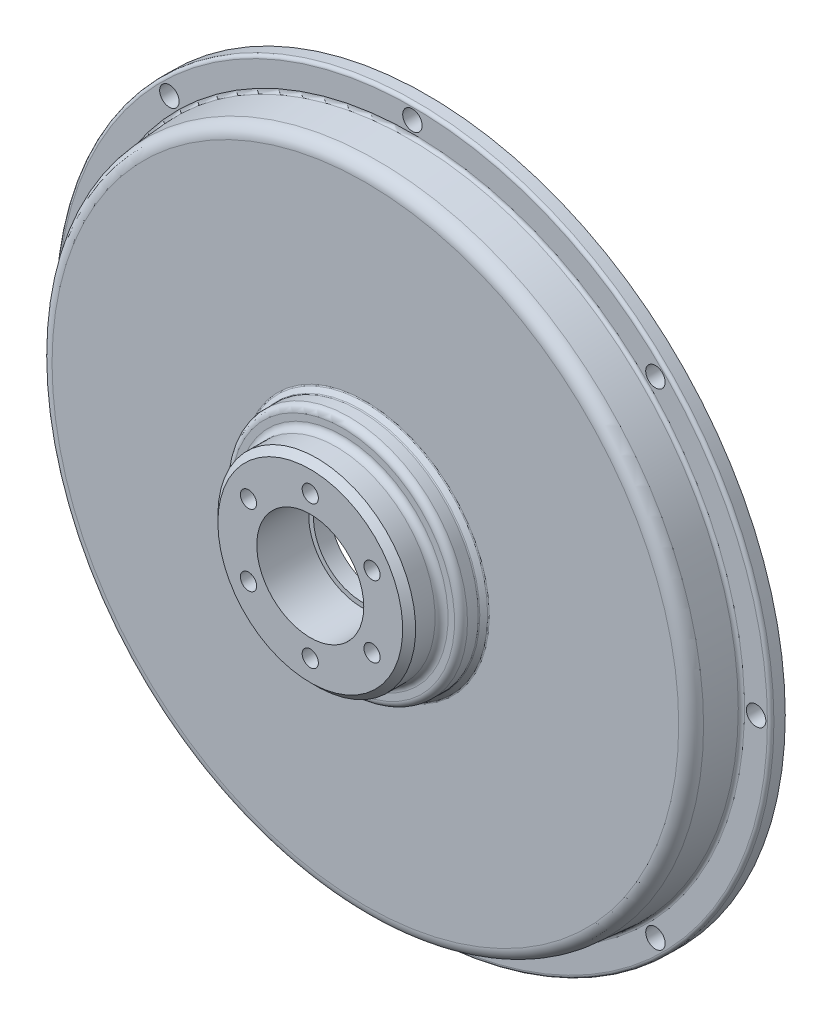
from build123d import *

# Parameters (mm, degrees)
FILLET_1_R          = 0.5
SKETCH_2_R          = 3
CUT_EXTRUDE_1_DEPTH = 10
SKETCH_3_R          = 16.5
CUT_EXTRUDE_2_DEPTH = 16
SKETCH_4_R          = 2.5
CUT_EXTRUDE_3_DEPTH = 15
SKETCH_5_R          = 95
CUT_EXTRUDE_4_DEPTH = 15
SKETCH_6_R          = 15
CUT_EXTRUDE_5_DEPTH = 15


with BuildPart() as part:
    # Sketch 1 → Revolve 1 (revolve)
    with BuildSketch(Plane(origin=(0, 0, 0), x_dir=(1, 0, 0), z_dir=(0, 1, 0))):
        with BuildLine():
            Line((-110.5, 0), (-110.5, -3.5))
            ThreePointArc((-110.5, -3.5), (-110.207106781, -4.207106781), (-109.5, -4.5))
            Line((-109.5, -4.5), (-102.422405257, -4.5))
            ThreePointArc((-102.422405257, -4.5), (-101.744391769, -4.764950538), (-101.425658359, -5.419404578))
            Line((-101.425658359, -5.419404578), (-100.624918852, -15.322381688))
            ThreePointArc((-100.624918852, -15.322381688), (-99.34998521, -17.940197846), (-96.637931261, -19))
            Line((-96.637931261, -19), (-38, -19))
            Line((-38, -19), (-36.5, -20.5))
            Line((-36.5, -20.5), (-36.5, -24))
            ThreePointArc((-36.5, -24), (-35.914213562, -25.414213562), (-34.5, -26))
            Line((-34.5, -26), (-32.5, -26))
            ThreePointArc((-32.5, -26), (-31.085786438, -26.585786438), (-30.5, -28))
            Line((-30.5, -28), (-30.5, -34))
            Line((-30.5, -34), (-28.5, -36))
            Line((-28.5, -36), (0, -36))
            Line((0, -36), (0, 0))
            Line((0, 0), (-110.5, 0))
        make_face()
    revolve(axis=Axis((0, 0, 0), (0, 0, 1)))

    # Fillet 1
    fillet_1_edges = [part.edges().sort_by_distance(p)[0] for p in [
        (38, 0, 19),
        (36.5, 0, 20.5),
    ]]
    fillet(fillet_1_edges, radius=FILLET_1_R)

    # Sketch 2 → Cut-Extrude 1 (cut)
    with BuildSketch(Plane.XY.offset(4.5)):
        with Locations((0, 106)):
            Circle(SKETCH_2_R)
        with Locations((74.953318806, 74.953318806)):
            Circle(SKETCH_2_R)
        with Locations((106, 0)):
            Circle(SKETCH_2_R)
        with Locations((74.953318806, -74.953318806)):
            Circle(SKETCH_2_R)
        with Locations((0, -106)):
            Circle(SKETCH_2_R)
        with Locations((-74.953318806, -74.953318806)):
            Circle(SKETCH_2_R)
        with Locations((-106, 0)):
            Circle(SKETCH_2_R)
        with Locations((-74.953318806, 74.953318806)):
            Circle(SKETCH_2_R)
    extrude(amount=-CUT_EXTRUDE_1_DEPTH, mode=Mode.SUBTRACT)

    # Sketch 3 → Cut-Extrude 2 (cut)
    with BuildSketch(Plane.XY.offset(36)):
        Circle(SKETCH_3_R)
    extrude(amount=-CUT_EXTRUDE_2_DEPTH, mode=Mode.SUBTRACT)

    # Sketch 4 → Cut-Extrude 3 (cut)
    with BuildSketch(Plane.XY.offset(36)):
        with Locations((0, 22)):
            Circle(SKETCH_4_R)
        with Locations((19.052558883, 11)):
            Circle(SKETCH_4_R)
        with Locations((19.052558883, -11)):
            Circle(SKETCH_4_R)
        with Locations((0, -22)):
            Circle(SKETCH_4_R)
        with Locations((-19.052558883, -11)):
            Circle(SKETCH_4_R)
        with Locations((-19.052558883, 11)):
            Circle(SKETCH_4_R)
    extrude(amount=-CUT_EXTRUDE_3_DEPTH, mode=Mode.SUBTRACT)

    # Sketch 5 → Cut-Extrude 4 (cut)
    with BuildSketch(Plane(origin=(0, 0, 0), x_dir=(-1, 0, 0), z_dir=(0, 0, -1))):
        Circle(SKETCH_5_R)
    extrude(amount=-CUT_EXTRUDE_4_DEPTH, mode=Mode.SUBTRACT)

    # Sketch 6 → Cut-Extrude 5 (cut)
    with BuildSketch(Plane.XY.offset(20)):
        Circle(SKETCH_6_R)
    extrude(amount=-CUT_EXTRUDE_5_DEPTH, mode=Mode.SUBTRACT)


solid = part.part
